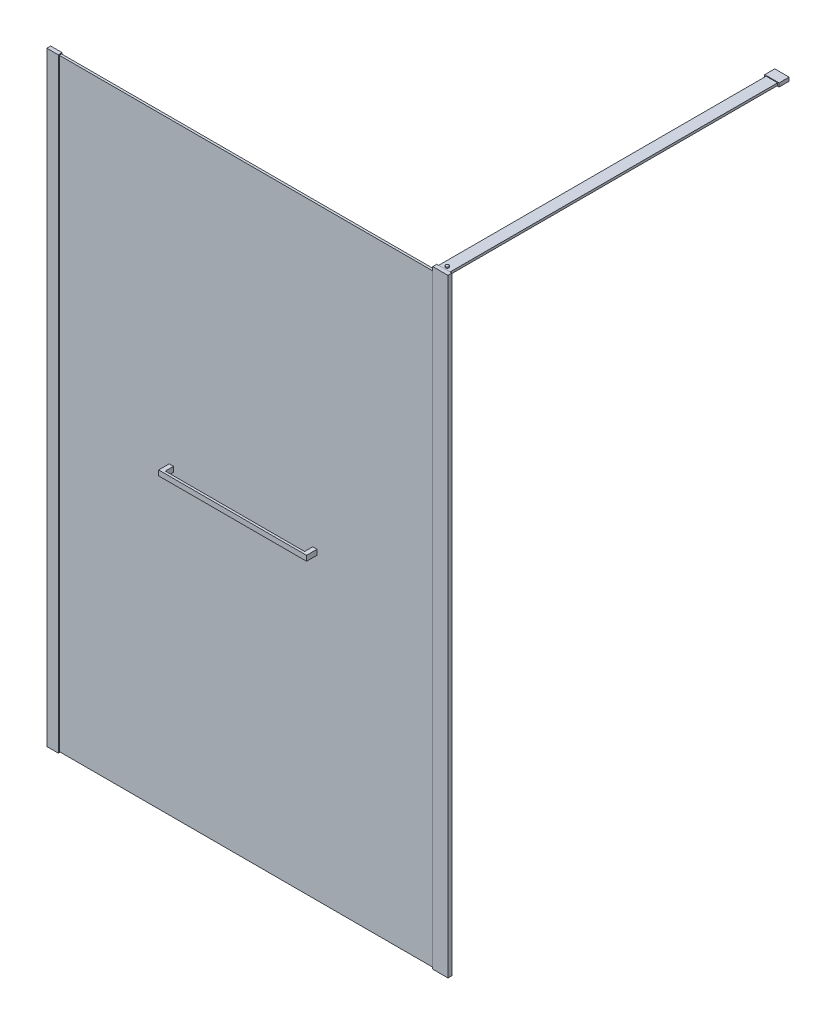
ISO-10303-21;
HEADER;
FILE_DESCRIPTION(('STEP AP214'),'2;1');
FILE_NAME('part.step','',(''),(''),'','','');
FILE_SCHEMA(('AUTOMOTIVE_DESIGN { 1 0 10303 214 1 1 1 1 }'));
ENDSEC;
DATA;
#1=APPLICATION_CONTEXT('core data for automotive mechanical design processes');
#2=APPLICATION_PROTOCOL_DEFINITION('international standard','automotive_design',2000,#1);
#3=PRODUCT_CONTEXT('',#1,'mechanical');
#4=PRODUCT('Part','Part','',(#3));
#5=PRODUCT_RELATED_PRODUCT_CATEGORY('part','',(#4));
#6=PRODUCT_DEFINITION_FORMATION('','',#4);
#7=PRODUCT_DEFINITION_CONTEXT('part definition',#1,'design');
#8=PRODUCT_DEFINITION('design','',#6,#7);
#9=PRODUCT_DEFINITION_SHAPE('','',#8);
#10=(LENGTH_UNIT() NAMED_UNIT(*) SI_UNIT(.MILLI.,.METRE.));
#11=(NAMED_UNIT(*) PLANE_ANGLE_UNIT() SI_UNIT($,.RADIAN.));
#12=(NAMED_UNIT(*) SI_UNIT($,.STERADIAN.) SOLID_ANGLE_UNIT());
#13=UNCERTAINTY_MEASURE_WITH_UNIT(LENGTH_MEASURE(1.E-05),#10,'distance_accuracy_value','');
#14=(GEOMETRIC_REPRESENTATION_CONTEXT(3) GLOBAL_UNCERTAINTY_ASSIGNED_CONTEXT((#13)) GLOBAL_UNIT_ASSIGNED_CONTEXT((#10,
#11,#12)) REPRESENTATION_CONTEXT('',''));
#15=CARTESIAN_POINT('',(0.,0.,0.));
#16=DIRECTION('',(0.,0.,1.));
#17=DIRECTION('',(1.,0.,0.));
#18=AXIS2_PLACEMENT_3D('',#15,#16,#17);
#19=CARTESIAN_POINT('',(437.5,1062.,-21.4));
#20=DIRECTION('',(1.,0.,0.));
#21=DIRECTION('',(0.,0.,-1.));
#22=AXIS2_PLACEMENT_3D('',#19,#20,#21);
#23=PLANE('',#22);
#24=DIRECTION('',(0.,1.,0.));
#25=VECTOR('',#24,1.);
#26=CARTESIAN_POINT('',(437.5,1062.,25.1));
#27=LINE('',#26,#25);
#28=CARTESIAN_POINT('',(437.5,1044.,25.1));
#29=VERTEX_POINT('',#28);
#30=CARTESIAN_POINT('',(437.5,1062.,25.1));
#31=VERTEX_POINT('',#30);
#32=EDGE_CURVE('E63',#29,#31,#27,.T.);
#33=ORIENTED_EDGE('',*,*,#32,.F.);
#34=DIRECTION('',(0.,0.,1.));
#35=VECTOR('',#34,1.);
#36=CARTESIAN_POINT('',(437.5,1044.,-21.4));
#37=LINE('',#36,#35);
#38=CARTESIAN_POINT('',(437.5,1044.,-21.4));
#39=VERTEX_POINT('',#38);
#40=EDGE_CURVE('E12',#39,#29,#37,.T.);
#41=ORIENTED_EDGE('',*,*,#40,.F.);
#42=DIRECTION('',(0.,1.,0.));
#43=VECTOR('',#42,1.);
#44=CARTESIAN_POINT('',(437.5,1062.,-21.4));
#45=LINE('',#44,#43);
#46=CARTESIAN_POINT('',(437.5,1062.,-21.4));
#47=VERTEX_POINT('',#46);
#48=EDGE_CURVE('E193',#39,#47,#45,.T.);
#49=ORIENTED_EDGE('',*,*,#48,.T.);
#50=DIRECTION('',(0.,0.,1.));
#51=VECTOR('',#50,1.);
#52=CARTESIAN_POINT('',(437.5,1062.,-21.4));
#53=LINE('',#52,#51);
#54=EDGE_CURVE('E176',#47,#31,#53,.T.);
#55=ORIENTED_EDGE('',*,*,#54,.T.);
#56=EDGE_LOOP('',(#33,#41,#49,#55));
#57=FACE_BOUND('',#56,.T.);
#58=ADVANCED_FACE('F46',(#57),#23,.T.);
#59=CARTESIAN_POINT('',(422.5,1044.,-21.4));
#60=DIRECTION('',(0.,-1.,0.));
#61=DIRECTION('',(0.,0.,-1.));
#62=AXIS2_PLACEMENT_3D('',#59,#60,#61);
#63=PLANE('',#62);
#64=ORIENTED_EDGE('',*,*,#40,.T.);
#65=DIRECTION('',(-1.,0.,0.));
#66=VECTOR('',#65,1.);
#67=CARTESIAN_POINT('',(942.197715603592,1044.,25.1));
#68=LINE('',#67,#66);
#69=CARTESIAN_POINT('',(922.5,1044.,25.1));
#70=VERTEX_POINT('',#69);
#71=EDGE_CURVE('E166',#70,#29,#68,.T.);
#72=ORIENTED_EDGE('',*,*,#71,.F.);
#73=DIRECTION('',(0.,0.,1.));
#74=VECTOR('',#73,1.);
#75=CARTESIAN_POINT('',(922.5,1044.,-21.4));
#76=LINE('',#75,#74);
#77=CARTESIAN_POINT('',(922.5,1044.,-21.4));
#78=VERTEX_POINT('',#77);
#79=EDGE_CURVE('E149',#78,#70,#76,.T.);
#80=ORIENTED_EDGE('',*,*,#79,.F.);
#81=DIRECTION('',(1.,0.,0.));
#82=VECTOR('',#81,1.);
#83=CARTESIAN_POINT('',(922.5,1044.,-21.4));
#84=LINE('',#83,#82);
#85=CARTESIAN_POINT('',(937.5,1044.,-21.4));
#86=VERTEX_POINT('',#85);
#87=EDGE_CURVE('E131',#78,#86,#84,.T.);
#88=ORIENTED_EDGE('',*,*,#87,.T.);
#89=DIRECTION('',(0.,0.,1.));
#90=VECTOR('',#89,1.);
#91=CARTESIAN_POINT('',(937.5,1044.,-21.4));
#92=LINE('',#91,#90);
#93=CARTESIAN_POINT('',(937.5,1044.,33.1));
#94=VERTEX_POINT('',#93);
#95=EDGE_CURVE('E147',#86,#94,#92,.T.);
#96=ORIENTED_EDGE('',*,*,#95,.T.);
#97=DIRECTION('',(1.,0.,0.));
#98=VECTOR('',#97,1.);
#99=CARTESIAN_POINT('',(422.5,1044.,33.1));
#100=LINE('',#99,#98);
#101=CARTESIAN_POINT('',(422.5,1044.,33.1));
#102=VERTEX_POINT('',#101);
#103=EDGE_CURVE('E135',#102,#94,#100,.T.);
#104=ORIENTED_EDGE('',*,*,#103,.F.);
#105=DIRECTION('',(0.,0.,1.));
#106=VECTOR('',#105,1.);
#107=CARTESIAN_POINT('',(422.5,1044.,-21.4));
#108=LINE('',#107,#106);
#109=CARTESIAN_POINT('',(422.5,1044.,-21.4));
#110=VERTEX_POINT('',#109);
#111=EDGE_CURVE('E55',#110,#102,#108,.T.);
#112=ORIENTED_EDGE('',*,*,#111,.F.);
#113=DIRECTION('',(1.,0.,0.));
#114=VECTOR('',#113,1.);
#115=CARTESIAN_POINT('',(422.5,1044.,-21.4));
#116=LINE('',#115,#114);
#117=EDGE_CURVE('E181',#110,#39,#116,.T.);
#118=ORIENTED_EDGE('',*,*,#117,.T.);
#119=EDGE_LOOP('',(#64,#72,#80,#88,#96,#104,#112,#118));
#120=FACE_BOUND('',#119,.T.);
#121=ADVANCED_FACE('F197',(#120),#63,.T.);
#122=CARTESIAN_POINT('',(422.5,1062.,-21.4));
#123=DIRECTION('',(-1.,0.,0.));
#124=DIRECTION('',(0.,0.,1.));
#125=AXIS2_PLACEMENT_3D('',#122,#123,#124);
#126=PLANE('',#125);
#127=ORIENTED_EDGE('',*,*,#111,.T.);
#128=DIRECTION('',(0.,-1.,0.));
#129=VECTOR('',#128,1.);
#130=CARTESIAN_POINT('',(422.5,1062.,33.1));
#131=LINE('',#130,#129);
#132=CARTESIAN_POINT('',(422.5,1062.,33.1));
#133=VERTEX_POINT('',#132);
#134=EDGE_CURVE('E121',#133,#102,#131,.T.);
#135=ORIENTED_EDGE('',*,*,#134,.F.);
#136=DIRECTION('',(0.,0.,1.));
#137=VECTOR('',#136,1.);
#138=CARTESIAN_POINT('',(422.5,1062.,-21.4));
#139=LINE('',#138,#137);
#140=CARTESIAN_POINT('',(422.5,1062.,-21.4));
#141=VERTEX_POINT('',#140);
#142=EDGE_CURVE('E116',#141,#133,#139,.T.);
#143=ORIENTED_EDGE('',*,*,#142,.F.);
#144=DIRECTION('',(0.,-1.,0.));
#145=VECTOR('',#144,1.);
#146=CARTESIAN_POINT('',(422.5,1062.,-21.4));
#147=LINE('',#146,#145);
#148=EDGE_CURVE('E186',#141,#110,#147,.T.);
#149=ORIENTED_EDGE('',*,*,#148,.T.);
#150=EDGE_LOOP('',(#127,#135,#143,#149));
#151=FACE_BOUND('',#150,.T.);
#152=ADVANCED_FACE('F218',(#151),#126,.T.);
#153=CARTESIAN_POINT('',(422.5,1062.,-21.4));
#154=DIRECTION('',(0.,1.,0.));
#155=DIRECTION('',(0.,0.,1.));
#156=AXIS2_PLACEMENT_3D('',#153,#154,#155);
#157=PLANE('',#156);
#158=ORIENTED_EDGE('',*,*,#142,.T.);
#159=DIRECTION('',(-1.,0.,0.));
#160=VECTOR('',#159,1.);
#161=CARTESIAN_POINT('',(422.5,1062.,33.1));
#162=LINE('',#161,#160);
#163=CARTESIAN_POINT('',(937.5,1062.,33.1));
#164=VERTEX_POINT('',#163);
#165=EDGE_CURVE('E109',#164,#133,#162,.T.);
#166=ORIENTED_EDGE('',*,*,#165,.F.);
#167=DIRECTION('',(0.,0.,1.));
#168=VECTOR('',#167,1.);
#169=CARTESIAN_POINT('',(937.5,1062.,-21.4));
#170=LINE('',#169,#168);
#171=CARTESIAN_POINT('',(937.5,1062.,-21.4));
#172=VERTEX_POINT('',#171);
#173=EDGE_CURVE('E113',#172,#164,#170,.T.);
#174=ORIENTED_EDGE('',*,*,#173,.F.);
#175=DIRECTION('',(-1.,0.,0.));
#176=VECTOR('',#175,1.);
#177=CARTESIAN_POINT('',(922.5,1062.,-21.4));
#178=LINE('',#177,#176);
#179=CARTESIAN_POINT('',(922.5,1062.,-21.4));
#180=VERTEX_POINT('',#179);
#181=EDGE_CURVE('E138',#172,#180,#178,.T.);
#182=ORIENTED_EDGE('',*,*,#181,.T.);
#183=DIRECTION('',(0.,0.,1.));
#184=VECTOR('',#183,1.);
#185=CARTESIAN_POINT('',(922.5,1062.,-21.4));
#186=LINE('',#185,#184);
#187=CARTESIAN_POINT('',(922.5,1062.,25.1));
#188=VERTEX_POINT('',#187);
#189=EDGE_CURVE('E130',#180,#188,#186,.T.);
#190=ORIENTED_EDGE('',*,*,#189,.T.);
#191=DIRECTION('',(-1.,0.,0.));
#192=VECTOR('',#191,1.);
#193=CARTESIAN_POINT('',(942.197715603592,1062.,25.1));
#194=LINE('',#193,#192);
#195=EDGE_CURVE('E163',#188,#31,#194,.T.);
#196=ORIENTED_EDGE('',*,*,#195,.T.);
#197=ORIENTED_EDGE('',*,*,#54,.F.);
#198=DIRECTION('',(-1.,0.,0.));
#199=VECTOR('',#198,1.);
#200=CARTESIAN_POINT('',(422.5,1062.,-21.4));
#201=LINE('',#200,#199);
#202=EDGE_CURVE('E190',#47,#141,#201,.T.);
#203=ORIENTED_EDGE('',*,*,#202,.T.);
#204=EDGE_LOOP('',(#158,#166,#174,#182,#190,#196,#197,#203));
#205=FACE_BOUND('',#204,.T.);
#206=ADVANCED_FACE('F111',(#205),#157,.T.);
#207=CARTESIAN_POINT('',(437.5,1044.,-21.4));
#208=DIRECTION('',(0.,0.,1.));
#209=DIRECTION('',(1.,0.,0.));
#210=AXIS2_PLACEMENT_3D('',#207,#208,#209);
#211=PLANE('',#210);
#212=ORIENTED_EDGE('',*,*,#48,.F.);
#213=ORIENTED_EDGE('',*,*,#117,.F.);
#214=ORIENTED_EDGE('',*,*,#148,.F.);
#215=ORIENTED_EDGE('',*,*,#202,.F.);
#216=EDGE_LOOP('',(#212,#213,#214,#215));
#217=FACE_BOUND('',#216,.T.);
#218=ADVANCED_FACE('F225',(#217),#211,.F.);
#219=CARTESIAN_POINT('',(437.5,1044.,33.1));
#220=DIRECTION('',(0.,0.,1.));
#221=DIRECTION('',(1.,0.,0.));
#222=AXIS2_PLACEMENT_3D('',#219,#220,#221);
#223=PLANE('',#222);
#224=ORIENTED_EDGE('',*,*,#103,.T.);
#225=DIRECTION('',(0.,1.,0.));
#226=VECTOR('',#225,1.);
#227=CARTESIAN_POINT('',(937.5,1062.,33.1));
#228=LINE('',#227,#226);
#229=EDGE_CURVE('E127',#94,#164,#228,.T.);
#230=ORIENTED_EDGE('',*,*,#229,.T.);
#231=ORIENTED_EDGE('',*,*,#165,.T.);
#232=ORIENTED_EDGE('',*,*,#134,.T.);
#233=EDGE_LOOP('',(#224,#230,#231,#232));
#234=FACE_BOUND('',#233,.T.);
#235=ADVANCED_FACE('F133',(#234),#223,.T.);
#236=CARTESIAN_POINT('',(942.197715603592,1062.,25.1));
#237=DIRECTION('',(0.,0.,1.));
#238=DIRECTION('',(1.,0.,0.));
#239=AXIS2_PLACEMENT_3D('',#236,#237,#238);
#240=PLANE('',#239);
#241=ORIENTED_EDGE('',*,*,#195,.F.);
#242=DIRECTION('',(0.,-1.,0.));
#243=VECTOR('',#242,1.);
#244=CARTESIAN_POINT('',(922.5,1062.,25.1));
#245=LINE('',#244,#243);
#246=EDGE_CURVE('E49',#188,#70,#245,.T.);
#247=ORIENTED_EDGE('',*,*,#246,.T.);
#248=ORIENTED_EDGE('',*,*,#71,.T.);
#249=ORIENTED_EDGE('',*,*,#32,.T.);
#250=EDGE_LOOP('',(#241,#247,#248,#249));
#251=FACE_BOUND('',#250,.T.);
#252=ADVANCED_FACE('F203',(#251),#240,.F.);
#253=CARTESIAN_POINT('',(922.5,1062.,-21.4));
#254=DIRECTION('',(-1.,0.,0.));
#255=DIRECTION('',(0.,0.,1.));
#256=AXIS2_PLACEMENT_3D('',#253,#254,#255);
#257=PLANE('',#256);
#258=ORIENTED_EDGE('',*,*,#246,.F.);
#259=ORIENTED_EDGE('',*,*,#189,.F.);
#260=DIRECTION('',(0.,-1.,0.));
#261=VECTOR('',#260,1.);
#262=CARTESIAN_POINT('',(922.5,1062.,-21.4));
#263=LINE('',#262,#261);
#264=EDGE_CURVE('E142',#180,#78,#263,.T.);
#265=ORIENTED_EDGE('',*,*,#264,.T.);
#266=ORIENTED_EDGE('',*,*,#79,.T.);
#267=EDGE_LOOP('',(#258,#259,#265,#266));
#268=FACE_BOUND('',#267,.T.);
#269=ADVANCED_FACE('F204',(#268),#257,.T.);
#270=CARTESIAN_POINT('',(937.5,1062.,-21.4));
#271=DIRECTION('',(1.,0.,0.));
#272=DIRECTION('',(0.,0.,-1.));
#273=AXIS2_PLACEMENT_3D('',#270,#271,#272);
#274=PLANE('',#273);
#275=ORIENTED_EDGE('',*,*,#173,.T.);
#276=ORIENTED_EDGE('',*,*,#229,.F.);
#277=ORIENTED_EDGE('',*,*,#95,.F.);
#278=DIRECTION('',(0.,1.,0.));
#279=VECTOR('',#278,1.);
#280=CARTESIAN_POINT('',(937.5,1062.,-21.4));
#281=LINE('',#280,#279);
#282=EDGE_CURVE('E129',#86,#172,#281,.T.);
#283=ORIENTED_EDGE('',*,*,#282,.T.);
#284=EDGE_LOOP('',(#275,#276,#277,#283));
#285=FACE_BOUND('',#284,.T.);
#286=ADVANCED_FACE('F126',(#285),#274,.T.);
#287=CARTESIAN_POINT('',(937.5,1044.,-21.4));
#288=DIRECTION('',(0.,0.,1.));
#289=DIRECTION('',(1.,0.,0.));
#290=AXIS2_PLACEMENT_3D('',#287,#288,#289);
#291=PLANE('',#290);
#292=ORIENTED_EDGE('',*,*,#282,.F.);
#293=ORIENTED_EDGE('',*,*,#87,.F.);
#294=ORIENTED_EDGE('',*,*,#264,.F.);
#295=ORIENTED_EDGE('',*,*,#181,.F.);
#296=EDGE_LOOP('',(#292,#293,#294,#295));
#297=FACE_BOUND('',#296,.T.);
#298=ADVANCED_FACE('F200',(#297),#291,.F.);
#299=CLOSED_SHELL('',(#58,#121,#152,#206,#218,#235,#252,#269,#286,#298));
#300=MANIFOLD_SOLID_BREP('B2',#299);
#301=CARTESIAN_POINT('',(1389.9,2119.,-1184.4));
#302=DIRECTION('',(-1.,0.,0.));
#303=DIRECTION('',(0.,0.,1.));
#304=AXIS2_PLACEMENT_3D('',#301,#302,#303);
#305=PLANE('',#304);
#306=DIRECTION('',(0.,-1.,0.));
#307=VECTOR('',#306,1.);
#308=CARTESIAN_POINT('',(1389.9,2119.,-1155.));
#309=LINE('',#308,#307);
#310=CARTESIAN_POINT('',(1389.9,2119.,-1155.));
#311=VERTEX_POINT('',#310);
#312=CARTESIAN_POINT('',(1389.9,2111.,-1155.));
#313=VERTEX_POINT('',#312);
#314=EDGE_CURVE('E417',#311,#313,#309,.T.);
#315=ORIENTED_EDGE('',*,*,#314,.F.);
#316=DIRECTION('',(0.,0.,1.));
#317=VECTOR('',#316,1.);
#318=CARTESIAN_POINT('',(1389.9,2119.,-1184.4));
#319=LINE('',#318,#317);
#320=CARTESIAN_POINT('',(1389.9,2119.,-14.3999999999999));
#321=VERTEX_POINT('',#320);
#322=EDGE_CURVE('E432',#311,#321,#319,.T.);
#323=ORIENTED_EDGE('',*,*,#322,.T.);
#324=DIRECTION('',(0.,-1.,0.));
#325=VECTOR('',#324,1.);
#326=CARTESIAN_POINT('',(1389.9,2119.,-14.3999999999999));
#327=LINE('',#326,#325);
#328=CARTESIAN_POINT('',(1389.9,2111.,-14.3999999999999));
#329=VERTEX_POINT('',#328);
#330=EDGE_CURVE('E420',#321,#329,#327,.T.);
#331=ORIENTED_EDGE('',*,*,#330,.T.);
#332=DIRECTION('',(0.,0.,1.));
#333=VECTOR('',#332,1.);
#334=CARTESIAN_POINT('',(1389.9,2111.,-1184.4));
#335=LINE('',#334,#333);
#336=EDGE_CURVE('E327',#313,#329,#335,.T.);
#337=ORIENTED_EDGE('',*,*,#336,.F.);
#338=EDGE_LOOP('',(#315,#323,#331,#337));
#339=FACE_BOUND('',#338,.T.);
#340=ADVANCED_FACE('F319',(#339),#305,.F.);
#341=CARTESIAN_POINT('',(1389.9,2111.,-1184.4));
#342=DIRECTION('',(0.,1.,0.));
#343=DIRECTION('',(0.,0.,1.));
#344=AXIS2_PLACEMENT_3D('',#341,#342,#343);
#345=PLANE('',#344);
#346=DIRECTION('',(-1.,0.,0.));
#347=VECTOR('',#346,1.);
#348=CARTESIAN_POINT('',(1389.9,2111.,-1155.));
#349=LINE('',#348,#347);
#350=CARTESIAN_POINT('',(1349.9,2111.,-1155.));
#351=VERTEX_POINT('',#350);
#352=EDGE_CURVE('E334',#313,#351,#349,.T.);
#353=ORIENTED_EDGE('',*,*,#352,.F.);
#354=ORIENTED_EDGE('',*,*,#336,.T.);
#355=DIRECTION('',(-1.,0.,0.));
#356=VECTOR('',#355,1.);
#357=CARTESIAN_POINT('',(1389.9,2111.,-14.3999999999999));
#358=LINE('',#357,#356);
#359=CARTESIAN_POINT('',(1349.9,2111.,-14.3999999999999));
#360=VERTEX_POINT('',#359);
#361=EDGE_CURVE('E423',#329,#360,#358,.T.);
#362=ORIENTED_EDGE('',*,*,#361,.T.);
#363=DIRECTION('',(0.,0.,1.));
#364=VECTOR('',#363,1.);
#365=CARTESIAN_POINT('',(1349.9,2111.,-1184.4));
#366=LINE('',#365,#364);
#367=EDGE_CURVE('E436',#351,#360,#366,.T.);
#368=ORIENTED_EDGE('',*,*,#367,.F.);
#369=EDGE_LOOP('',(#353,#354,#362,#368));
#370=FACE_BOUND('',#369,.T.);
#371=ADVANCED_FACE('F438',(#370),#345,.F.);
#372=CARTESIAN_POINT('',(1349.9,2119.,-1184.4));
#373=DIRECTION('',(1.,0.,0.));
#374=DIRECTION('',(0.,0.,-1.));
#375=AXIS2_PLACEMENT_3D('',#372,#373,#374);
#376=PLANE('',#375);
#377=DIRECTION('',(0.,1.,0.));
#378=VECTOR('',#377,1.);
#379=CARTESIAN_POINT('',(1349.9,2119.,-1155.));
#380=LINE('',#379,#378);
#381=CARTESIAN_POINT('',(1349.9,2119.,-1155.));
#382=VERTEX_POINT('',#381);
#383=EDGE_CURVE('E342',#351,#382,#380,.T.);
#384=ORIENTED_EDGE('',*,*,#383,.F.);
#385=ORIENTED_EDGE('',*,*,#367,.T.);
#386=DIRECTION('',(0.,1.,0.));
#387=VECTOR('',#386,1.);
#388=CARTESIAN_POINT('',(1349.9,2119.,-14.3999999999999));
#389=LINE('',#388,#387);
#390=CARTESIAN_POINT('',(1349.9,2119.,-14.3999999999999));
#391=VERTEX_POINT('',#390);
#392=EDGE_CURVE('E426',#360,#391,#389,.T.);
#393=ORIENTED_EDGE('',*,*,#392,.T.);
#394=DIRECTION('',(0.,0.,1.));
#395=VECTOR('',#394,1.);
#396=CARTESIAN_POINT('',(1349.9,2119.,-1184.4));
#397=LINE('',#396,#395);
#398=EDGE_CURVE('E434',#382,#391,#397,.T.);
#399=ORIENTED_EDGE('',*,*,#398,.F.);
#400=EDGE_LOOP('',(#384,#385,#393,#399));
#401=FACE_BOUND('',#400,.T.);
#402=ADVANCED_FACE('F448',(#401),#376,.F.);
#403=CARTESIAN_POINT('',(1389.9,2119.,-1184.4));
#404=DIRECTION('',(0.,-1.,0.));
#405=DIRECTION('',(0.,0.,-1.));
#406=AXIS2_PLACEMENT_3D('',#403,#404,#405);
#407=PLANE('',#406);
#408=CARTESIAN_POINT('',(1369.9,2119.,-24.3999999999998));
#409=DIRECTION('',(0.,-1.,0.));
#410=DIRECTION('',(0.,0.,-1.));
#411=AXIS2_PLACEMENT_3D('',#408,#409,#410);
#412=CIRCLE('',#411,5.90000000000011);
#413=CARTESIAN_POINT('',(1369.9,2119.,-30.2999999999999));
#414=VERTEX_POINT('',#413);
#415=EDGE_CURVE('E511',#414,#414,#412,.T.);
#416=ORIENTED_EDGE('',*,*,#415,.T.);
#417=EDGE_LOOP('',(#416));
#418=FACE_BOUND('',#417,.T.);
#419=DIRECTION('',(1.,0.,0.));
#420=VECTOR('',#419,1.);
#421=CARTESIAN_POINT('',(1389.9,2119.,-1155.));
#422=LINE('',#421,#420);
#423=EDGE_CURVE('E44',#382,#311,#422,.T.);
#424=ORIENTED_EDGE('',*,*,#423,.F.);
#425=ORIENTED_EDGE('',*,*,#398,.T.);
#426=DIRECTION('',(1.,0.,0.));
#427=VECTOR('',#426,1.);
#428=CARTESIAN_POINT('',(1389.9,2119.,-14.3999999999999));
#429=LINE('',#428,#427);
#430=EDGE_CURVE('E429',#391,#321,#429,.T.);
#431=ORIENTED_EDGE('',*,*,#430,.T.);
#432=ORIENTED_EDGE('',*,*,#322,.F.);
#433=EDGE_LOOP('',(#424,#425,#431,#432));
#434=FACE_BOUND('',#433,.T.);
#435=ADVANCED_FACE('F447',(#418,#434),#407,.F.);
#436=CARTESIAN_POINT('',(1389.9,2111.,-14.3999999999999));
#437=DIRECTION('',(0.,0.,-1.));
#438=DIRECTION('',(-1.,0.,0.));
#439=AXIS2_PLACEMENT_3D('',#436,#437,#438);
#440=PLANE('',#439);
#441=ORIENTED_EDGE('',*,*,#330,.F.);
#442=ORIENTED_EDGE('',*,*,#430,.F.);
#443=ORIENTED_EDGE('',*,*,#392,.F.);
#444=ORIENTED_EDGE('',*,*,#361,.F.);
#445=EDGE_LOOP('',(#441,#442,#443,#444));
#446=FACE_BOUND('',#445,.T.);
#447=ADVANCED_FACE('F444',(#446),#440,.F.);
#448=CARTESIAN_POINT('',(1344.9,2108.75,-1155.));
#449=DIRECTION('',(0.,0.,-1.));
#450=DIRECTION('',(-1.,0.,0.));
#451=AXIS2_PLACEMENT_3D('',#448,#449,#450);
#452=PLANE('',#451);
#453=DIRECTION('',(0.,1.,0.));
#454=VECTOR('',#453,1.);
#455=CARTESIAN_POINT('',(1344.9,2121.25,-1155.));
#456=LINE('',#455,#454);
#457=CARTESIAN_POINT('',(1344.9,2108.75,-1155.));
#458=VERTEX_POINT('',#457);
#459=CARTESIAN_POINT('',(1344.9,2121.25,-1155.));
#460=VERTEX_POINT('',#459);
#461=EDGE_CURVE('E409',#458,#460,#456,.T.);
#462=ORIENTED_EDGE('',*,*,#461,.F.);
#463=DIRECTION('',(-1.,0.,0.));
#464=VECTOR('',#463,1.);
#465=CARTESIAN_POINT('',(1394.9,2108.75,-1155.));
#466=LINE('',#465,#464);
#467=CARTESIAN_POINT('',(1394.9,2108.75,-1155.));
#468=VERTEX_POINT('',#467);
#469=EDGE_CURVE('E405',#468,#458,#466,.T.);
#470=ORIENTED_EDGE('',*,*,#469,.F.);
#471=DIRECTION('',(0.,-1.,0.));
#472=VECTOR('',#471,1.);
#473=CARTESIAN_POINT('',(1394.9,2121.25,-1155.));
#474=LINE('',#473,#472);
#475=CARTESIAN_POINT('',(1394.9,2121.25,-1155.));
#476=VERTEX_POINT('',#475);
#477=EDGE_CURVE('E492',#476,#468,#474,.T.);
#478=ORIENTED_EDGE('',*,*,#477,.F.);
#479=DIRECTION('',(1.,0.,0.));
#480=VECTOR('',#479,1.);
#481=CARTESIAN_POINT('',(1394.9,2121.25,-1155.));
#482=LINE('',#481,#480);
#483=EDGE_CURVE('E495',#460,#476,#482,.T.);
#484=ORIENTED_EDGE('',*,*,#483,.F.);
#485=EDGE_LOOP('',(#462,#470,#478,#484));
#486=FACE_BOUND('',#485,.T.);
#487=ORIENTED_EDGE('',*,*,#423,.T.);
#488=ORIENTED_EDGE('',*,*,#314,.T.);
#489=ORIENTED_EDGE('',*,*,#352,.T.);
#490=ORIENTED_EDGE('',*,*,#383,.T.);
#491=EDGE_LOOP('',(#487,#488,#489,#490));
#492=FACE_BOUND('',#491,.T.);
#493=ADVANCED_FACE('F450',(#486,#492),#452,.F.);
#494=CARTESIAN_POINT('',(1344.9,2121.25,-1190.));
#495=DIRECTION('',(1.,0.,0.));
#496=DIRECTION('',(0.,0.,-1.));
#497=AXIS2_PLACEMENT_3D('',#494,#495,#496);
#498=PLANE('',#497);
#499=ORIENTED_EDGE('',*,*,#461,.T.);
#500=DIRECTION('',(0.,0.,1.));
#501=VECTOR('',#500,1.);
#502=CARTESIAN_POINT('',(1344.9,2121.25,-1190.));
#503=LINE('',#502,#501);
#504=CARTESIAN_POINT('',(1344.9,2121.25,-1190.));
#505=VERTEX_POINT('',#504);
#506=EDGE_CURVE('E389',#505,#460,#503,.T.);
#507=ORIENTED_EDGE('',*,*,#506,.F.);
#508=DIRECTION('',(0.,1.,0.));
#509=VECTOR('',#508,1.);
#510=CARTESIAN_POINT('',(1344.9,2121.25,-1190.));
#511=LINE('',#510,#509);
#512=CARTESIAN_POINT('',(1344.9,2108.75,-1190.));
#513=VERTEX_POINT('',#512);
#514=EDGE_CURVE('E396',#513,#505,#511,.T.);
#515=ORIENTED_EDGE('',*,*,#514,.F.);
#516=DIRECTION('',(0.,0.,1.));
#517=VECTOR('',#516,1.);
#518=CARTESIAN_POINT('',(1344.9,2108.75,-1190.));
#519=LINE('',#518,#517);
#520=EDGE_CURVE('E489',#513,#458,#519,.T.);
#521=ORIENTED_EDGE('',*,*,#520,.T.);
#522=EDGE_LOOP('',(#499,#507,#515,#521));
#523=FACE_BOUND('',#522,.T.);
#524=ADVANCED_FACE('F407',(#523),#498,.F.);
#525=CARTESIAN_POINT('',(1394.9,2121.25,-1190.));
#526=DIRECTION('',(0.,-1.,0.));
#527=DIRECTION('',(0.,0.,-1.));
#528=AXIS2_PLACEMENT_3D('',#525,#526,#527);
#529=PLANE('',#528);
#530=ORIENTED_EDGE('',*,*,#483,.T.);
#531=DIRECTION('',(0.,0.,1.));
#532=VECTOR('',#531,1.);
#533=CARTESIAN_POINT('',(1394.9,2121.25,-1190.));
#534=LINE('',#533,#532);
#535=CARTESIAN_POINT('',(1394.9,2121.25,-1190.));
#536=VERTEX_POINT('',#535);
#537=EDGE_CURVE('E392',#536,#476,#534,.T.);
#538=ORIENTED_EDGE('',*,*,#537,.F.);
#539=DIRECTION('',(1.,0.,0.));
#540=VECTOR('',#539,1.);
#541=CARTESIAN_POINT('',(1394.9,2121.25,-1190.));
#542=LINE('',#541,#540);
#543=EDGE_CURVE('E385',#505,#536,#542,.T.);
#544=ORIENTED_EDGE('',*,*,#543,.F.);
#545=ORIENTED_EDGE('',*,*,#506,.T.);
#546=EDGE_LOOP('',(#530,#538,#544,#545));
#547=FACE_BOUND('',#546,.T.);
#548=ADVANCED_FACE('F387',(#547),#529,.F.);
#549=CARTESIAN_POINT('',(1394.9,2121.25,-1190.));
#550=DIRECTION('',(-1.,0.,0.));
#551=DIRECTION('',(0.,0.,1.));
#552=AXIS2_PLACEMENT_3D('',#549,#550,#551);
#553=PLANE('',#552);
#554=ORIENTED_EDGE('',*,*,#477,.T.);
#555=DIRECTION('',(0.,0.,1.));
#556=VECTOR('',#555,1.);
#557=CARTESIAN_POINT('',(1394.9,2108.75,-1190.));
#558=LINE('',#557,#556);
#559=CARTESIAN_POINT('',(1394.9,2108.75,-1190.));
#560=VERTEX_POINT('',#559);
#561=EDGE_CURVE('E412',#560,#468,#558,.T.);
#562=ORIENTED_EDGE('',*,*,#561,.F.);
#563=DIRECTION('',(0.,-1.,0.));
#564=VECTOR('',#563,1.);
#565=CARTESIAN_POINT('',(1394.9,2121.25,-1190.));
#566=LINE('',#565,#564);
#567=EDGE_CURVE('E395',#536,#560,#566,.T.);
#568=ORIENTED_EDGE('',*,*,#567,.F.);
#569=ORIENTED_EDGE('',*,*,#537,.T.);
#570=EDGE_LOOP('',(#554,#562,#568,#569));
#571=FACE_BOUND('',#570,.T.);
#572=ADVANCED_FACE('F477',(#571),#553,.F.);
#573=CARTESIAN_POINT('',(1394.9,2108.75,-1190.));
#574=DIRECTION('',(0.,1.,0.));
#575=DIRECTION('',(0.,0.,1.));
#576=AXIS2_PLACEMENT_3D('',#573,#574,#575);
#577=PLANE('',#576);
#578=ORIENTED_EDGE('',*,*,#469,.T.);
#579=ORIENTED_EDGE('',*,*,#520,.F.);
#580=DIRECTION('',(-1.,0.,0.));
#581=VECTOR('',#580,1.);
#582=CARTESIAN_POINT('',(1394.9,2108.75,-1190.));
#583=LINE('',#582,#581);
#584=EDGE_CURVE('E401',#560,#513,#583,.T.);
#585=ORIENTED_EDGE('',*,*,#584,.F.);
#586=ORIENTED_EDGE('',*,*,#561,.T.);
#587=EDGE_LOOP('',(#578,#579,#585,#586));
#588=FACE_BOUND('',#587,.T.);
#589=ADVANCED_FACE('F479',(#588),#577,.F.);
#590=CARTESIAN_POINT('',(1344.9,2108.75,-1190.));
#591=DIRECTION('',(0.,0.,-1.));
#592=DIRECTION('',(-1.,0.,0.));
#593=AXIS2_PLACEMENT_3D('',#590,#591,#592);
#594=PLANE('',#593);
#595=ORIENTED_EDGE('',*,*,#514,.T.);
#596=ORIENTED_EDGE('',*,*,#543,.T.);
#597=ORIENTED_EDGE('',*,*,#567,.T.);
#598=ORIENTED_EDGE('',*,*,#584,.T.);
#599=EDGE_LOOP('',(#595,#596,#597,#598));
#600=FACE_BOUND('',#599,.T.);
#601=ADVANCED_FACE('F399',(#600),#594,.T.);
#602=CARTESIAN_POINT('',(1369.9,2115.34934210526,-24.3999999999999));
#603=DIRECTION('',(0.,-1.,0.));
#604=DIRECTION('',(0.,0.,-1.));
#605=AXIS2_PLACEMENT_3D('',#602,#603,#604);
#606=SPHERICAL_SURFACE('',#605,9.35065789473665);
#607=CARTESIAN_POINT('',(1369.9,2122.8,-24.3999999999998));
#608=DIRECTION('',(0.,-1.,0.));
#609=DIRECTION('',(0.,0.,-1.));
#610=AXIS2_PLACEMENT_3D('',#607,#608,#609);
#611=CIRCLE('',#610,5.65000000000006);
#612=CARTESIAN_POINT('',(1369.9,2122.8,-30.0499999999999));
#613=VERTEX_POINT('',#612);
#614=EDGE_CURVE('E508',#613,#613,#611,.T.);
#615=ORIENTED_EDGE('',*,*,#614,.F.);
#616=EDGE_LOOP('',(#615));
#617=FACE_BOUND('',#616,.T.);
#618=ADVANCED_FACE('F486',(#617),#606,.T.);
#619=CARTESIAN_POINT('',(1369.9,2119.,-24.3999999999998));
#620=DIRECTION('',(0.,-1.,0.));
#621=DIRECTION('',(0.,0.,-1.));
#622=AXIS2_PLACEMENT_3D('',#619,#620,#621);
#623=CONICAL_SURFACE('',#622,5.90000000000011,0.0656948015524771);
#624=ORIENTED_EDGE('',*,*,#614,.T.);
#625=EDGE_LOOP('',(#624));
#626=FACE_BOUND('',#625,.T.);
#627=ORIENTED_EDGE('',*,*,#415,.F.);
#628=EDGE_LOOP('',(#627));
#629=FACE_BOUND('',#628,.T.);
#630=ADVANCED_FACE('F515',(#626,#629),#623,.T.);
#631=CLOSED_SHELL('',(#340,#371,#402,#435,#447,#493,#524,#548,#572,#589,#601,#618,#630));
#632=CARTESIAN_POINT('',(1369.9,2122.53567623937,-24.3999999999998));
#633=DIRECTION('',(0.,-1.,0.));
#634=DIRECTION('',(0.,0.,-1.));
#635=AXIS2_PLACEMENT_3D('',#632,#633,#634);
#636=CONICAL_SURFACE('',#635,5.1663088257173,0.0656948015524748);
#637=CARTESIAN_POINT('',(1369.9,2119.,-24.3999999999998));
#638=DIRECTION('',(0.,-1.,0.));
#639=DIRECTION('',(0.,0.,-1.));
#640=AXIS2_PLACEMENT_3D('',#637,#638,#639);
#641=CIRCLE('',#640,5.398919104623);
#642=CARTESIAN_POINT('',(1369.9,2119.,-29.7989191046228));
#643=VERTEX_POINT('',#642);
#644=EDGE_CURVE('E496',#643,#643,#641,.T.);
#645=ORIENTED_EDGE('',*,*,#644,.T.);
#646=EDGE_LOOP('',(#645));
#647=FACE_BOUND('',#646,.T.);
#648=CARTESIAN_POINT('',(1369.9,2122.53567623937,-24.3999999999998));
#649=DIRECTION('',(0.,-1.,0.));
#650=DIRECTION('',(0.,0.,-1.));
#651=AXIS2_PLACEMENT_3D('',#648,#649,#650);
#652=CIRCLE('',#651,5.1663088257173);
#653=CARTESIAN_POINT('',(1369.9,2122.53567623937,-29.5663088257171));
#654=VERTEX_POINT('',#653);
#655=EDGE_CURVE('E500',#654,#654,#652,.T.);
#656=ORIENTED_EDGE('',*,*,#655,.F.);
#657=EDGE_LOOP('',(#656));
#658=FACE_BOUND('',#657,.T.);
#659=ADVANCED_FACE('F529',(#647,#658),#636,.F.);
#660=CARTESIAN_POINT('',(1369.9,2115.34934210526,-24.3999999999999));
#661=DIRECTION('',(0.,-1.,0.));
#662=DIRECTION('',(0.,0.,1.));
#663=AXIS2_PLACEMENT_3D('',#660,#661,#662);
#664=SPHERICAL_SURFACE('',#663,8.85065789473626);
#665=ORIENTED_EDGE('',*,*,#655,.T.);
#666=EDGE_LOOP('',(#665));
#667=FACE_BOUND('',#666,.T.);
#668=ADVANCED_FACE('F526',(#667),#664,.F.);
#669=ORIENTED_EDGE('',*,*,#644,.F.);
#670=EDGE_LOOP('',(#669));
#671=FACE_BOUND('',#670,.T.);
#672=ADVANCED_FACE('F473',(#671),#407,.F.);
#673=CLOSED_SHELL('',(#659,#668,#672));
#674=ORIENTED_CLOSED_SHELL('',*,#673,.T.);
#675=BREP_WITH_VOIDS('B6',#631,(#674));
#676=CARTESIAN_POINT('',(1396.4,2111.,-0.399999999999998));
#677=DIRECTION('',(0.,-1.,0.));
#678=DIRECTION('',(0.,0.,-1.));
#679=AXIS2_PLACEMENT_3D('',#676,#677,#678);
#680=PLANE('',#679);
#681=DIRECTION('',(-1.,0.,0.));
#682=VECTOR('',#681,1.);
#683=CARTESIAN_POINT('',(1343.4,2111.,-11.4));
#684=LINE('',#683,#682);
#685=CARTESIAN_POINT('',(1344.7,2111.,-11.4));
#686=VERTEX_POINT('',#685);
#687=CARTESIAN_POINT('',(1343.4,2111.,-11.4));
#688=VERTEX_POINT('',#687);
#689=EDGE_CURVE('E781',#686,#688,#684,.T.);
#690=ORIENTED_EDGE('',*,*,#689,.F.);
#691=DIRECTION('',(0.,0.,1.));
#692=VECTOR('',#691,1.);
#693=CARTESIAN_POINT('',(1344.7,2111.,-0.399999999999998));
#694=LINE('',#693,#692);
#695=CARTESIAN_POINT('',(1344.7,2111.,-3.39999999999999));
#696=VERTEX_POINT('',#695);
#697=EDGE_CURVE('E647',#686,#696,#694,.T.);
#698=ORIENTED_EDGE('',*,*,#697,.T.);
#699=DIRECTION('',(1.,0.,0.));
#700=VECTOR('',#699,1.);
#701=CARTESIAN_POINT('',(1353.5,2111.,-3.39999999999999));
#702=LINE('',#701,#700);
#703=CARTESIAN_POINT('',(1343.4,2111.,-3.39999999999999));
#704=VERTEX_POINT('',#703);
#705=EDGE_CURVE('E785',#704,#696,#702,.T.);
#706=ORIENTED_EDGE('',*,*,#705,.F.);
#707=DIRECTION('',(0.,0.,1.));
#708=VECTOR('',#707,1.);
#709=CARTESIAN_POINT('',(1343.4,2111.,-14.4));
#710=LINE('',#709,#708);
#711=EDGE_CURVE('E762',#688,#704,#710,.T.);
#712=ORIENTED_EDGE('',*,*,#711,.F.);
#713=EDGE_LOOP('',(#690,#698,#706,#712));
#714=FACE_BOUND('',#713,.T.);
#715=ADVANCED_FACE('F638',(#714),#680,.T.);
#716=CARTESIAN_POINT('',(1353.5,2111.,-3.39999999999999));
#717=DIRECTION('',(0.,0.,-1.));
#718=DIRECTION('',(-1.,0.,0.));
#719=AXIS2_PLACEMENT_3D('',#716,#717,#718);
#720=PLANE('',#719);
#721=DIRECTION('',(-1.,0.,0.));
#722=VECTOR('',#721,1.);
#723=CARTESIAN_POINT('',(1353.5,2103.2,-3.39999999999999));
#724=LINE('',#723,#722);
#725=CARTESIAN_POINT('',(1353.5,2103.2,-3.39999999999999));
#726=VERTEX_POINT('',#725);
#727=CARTESIAN_POINT('',(1344.7,2103.2,-3.39999999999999));
#728=VERTEX_POINT('',#727);
#729=EDGE_CURVE('E760',#726,#728,#724,.T.);
#730=ORIENTED_EDGE('',*,*,#729,.F.);
#731=DIRECTION('',(0.,-1.,0.));
#732=VECTOR('',#731,1.);
#733=CARTESIAN_POINT('',(1353.5,2111.,-3.39999999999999));
#734=LINE('',#733,#732);
#735=CARTESIAN_POINT('',(1353.5,3.,-3.39999999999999));
#736=VERTEX_POINT('',#735);
#737=EDGE_CURVE('E784',#726,#736,#734,.T.);
#738=ORIENTED_EDGE('',*,*,#737,.T.);
#739=DIRECTION('',(1.,0.,0.));
#740=VECTOR('',#739,1.);
#741=CARTESIAN_POINT('',(1353.5,3.,-3.39999999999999));
#742=LINE('',#741,#740);
#743=CARTESIAN_POINT('',(1343.4,3.,-3.39999999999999));
#744=VERTEX_POINT('',#743);
#745=EDGE_CURVE('E772',#744,#736,#742,.T.);
#746=ORIENTED_EDGE('',*,*,#745,.F.);
#747=DIRECTION('',(0.,-1.,0.));
#748=VECTOR('',#747,1.);
#749=CARTESIAN_POINT('',(1343.4,2111.,-3.39999999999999));
#750=LINE('',#749,#748);
#751=EDGE_CURVE('E663',#704,#744,#750,.T.);
#752=ORIENTED_EDGE('',*,*,#751,.F.);
#753=ORIENTED_EDGE('',*,*,#705,.T.);
#754=DIRECTION('',(0.,-1.,0.));
#755=VECTOR('',#754,1.);
#756=CARTESIAN_POINT('',(1344.7,2111.,-3.39999999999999));
#757=LINE('',#756,#755);
#758=EDGE_CURVE('E655',#696,#728,#757,.T.);
#759=ORIENTED_EDGE('',*,*,#758,.T.);
#760=EDGE_LOOP('',(#730,#738,#746,#752,#753,#759));
#761=FACE_BOUND('',#760,.T.);
#762=ADVANCED_FACE('F640',(#761),#720,.T.);
#763=CARTESIAN_POINT('',(1343.4,2111.,-3.39999999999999));
#764=DIRECTION('',(-1.,0.,0.));
#765=DIRECTION('',(0.,0.,1.));
#766=AXIS2_PLACEMENT_3D('',#763,#764,#765);
#767=PLANE('',#766);
#768=DIRECTION('',(0.,-1.,0.));
#769=VECTOR('',#768,1.);
#770=CARTESIAN_POINT('',(1343.4,2111.,-14.4));
#771=LINE('',#770,#769);
#772=CARTESIAN_POINT('',(1343.4,2119.,-14.4));
#773=VERTEX_POINT('',#772);
#774=CARTESIAN_POINT('',(1343.4,0.,-14.4));
#775=VERTEX_POINT('',#774);
#776=EDGE_CURVE('E719',#773,#775,#771,.T.);
#777=ORIENTED_EDGE('',*,*,#776,.T.);
#778=DIRECTION('',(0.,0.,-1.));
#779=VECTOR('',#778,1.);
#780=CARTESIAN_POINT('',(1343.4,0.,-0.399999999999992));
#781=LINE('',#780,#779);
#782=CARTESIAN_POINT('',(1343.4,0.,-0.399999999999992));
#783=VERTEX_POINT('',#782);
#784=EDGE_CURVE('E723',#783,#775,#781,.T.);
#785=ORIENTED_EDGE('',*,*,#784,.F.);
#786=DIRECTION('',(0.,-1.,0.));
#787=VECTOR('',#786,1.);
#788=CARTESIAN_POINT('',(1343.4,2111.,-0.399999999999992));
#789=LINE('',#788,#787);
#790=CARTESIAN_POINT('',(1343.4,2119.,-0.399999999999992));
#791=VERTEX_POINT('',#790);
#792=EDGE_CURVE('E793',#791,#783,#789,.T.);
#793=ORIENTED_EDGE('',*,*,#792,.F.);
#794=DIRECTION('',(0.,0.,1.));
#795=VECTOR('',#794,1.);
#796=CARTESIAN_POINT('',(1343.4,2119.,-14.4));
#797=LINE('',#796,#795);
#798=EDGE_CURVE('E725',#773,#791,#797,.T.);
#799=ORIENTED_EDGE('',*,*,#798,.F.);
#800=EDGE_LOOP('',(#777,#785,#793,#799));
#801=FACE_BOUND('',#800,.T.);
#802=ORIENTED_EDGE('',*,*,#751,.T.);
#803=DIRECTION('',(0.,0.,-1.));
#804=VECTOR('',#803,1.);
#805=CARTESIAN_POINT('',(1343.4,3.,-0.399999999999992));
#806=LINE('',#805,#804);
#807=CARTESIAN_POINT('',(1343.4,3.,-11.4));
#808=VERTEX_POINT('',#807);
#809=EDGE_CURVE('E744',#744,#808,#806,.T.);
#810=ORIENTED_EDGE('',*,*,#809,.T.);
#811=DIRECTION('',(0.,-1.,0.));
#812=VECTOR('',#811,1.);
#813=CARTESIAN_POINT('',(1343.4,2111.,-11.4));
#814=LINE('',#813,#812);
#815=EDGE_CURVE('E730',#688,#808,#814,.T.);
#816=ORIENTED_EDGE('',*,*,#815,.F.);
#817=ORIENTED_EDGE('',*,*,#711,.T.);
#818=EDGE_LOOP('',(#802,#810,#816,#817));
#819=FACE_BOUND('',#818,.T.);
#820=ADVANCED_FACE('F721',(#801,#819),#767,.T.);
#821=CARTESIAN_POINT('',(1343.4,2111.,-0.399999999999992));
#822=DIRECTION('',(0.,0.,1.));
#823=DIRECTION('',(1.,0.,0.));
#824=AXIS2_PLACEMENT_3D('',#821,#822,#823);
#825=PLANE('',#824);
#826=ORIENTED_EDGE('',*,*,#792,.T.);
#827=DIRECTION('',(-1.,0.,0.));
#828=VECTOR('',#827,1.);
#829=CARTESIAN_POINT('',(1343.4,0.,-0.399999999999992));
#830=LINE('',#829,#828);
#831=CARTESIAN_POINT('',(1396.4,0.,-0.399999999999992));
#832=VERTEX_POINT('',#831);
#833=EDGE_CURVE('E743',#832,#783,#830,.T.);
#834=ORIENTED_EDGE('',*,*,#833,.F.);
#835=DIRECTION('',(0.,-1.,0.));
#836=VECTOR('',#835,1.);
#837=CARTESIAN_POINT('',(1396.4,2111.,-0.399999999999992));
#838=LINE('',#837,#836);
#839=CARTESIAN_POINT('',(1396.4,2119.,-0.399999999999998));
#840=VERTEX_POINT('',#839);
#841=EDGE_CURVE('E795',#840,#832,#838,.T.);
#842=ORIENTED_EDGE('',*,*,#841,.F.);
#843=DIRECTION('',(1.,0.,0.));
#844=VECTOR('',#843,1.);
#845=CARTESIAN_POINT('',(1396.4,2119.,-0.399999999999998));
#846=LINE('',#845,#844);
#847=EDGE_CURVE('E769',#791,#840,#846,.T.);
#848=ORIENTED_EDGE('',*,*,#847,.F.);
#849=EDGE_LOOP('',(#826,#834,#842,#848));
#850=FACE_BOUND('',#849,.T.);
#851=ADVANCED_FACE('F822',(#850),#825,.T.);
#852=CARTESIAN_POINT('',(1396.4,2111.,-0.399999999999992));
#853=DIRECTION('',(1.,0.,0.));
#854=DIRECTION('',(0.,0.,-1.));
#855=AXIS2_PLACEMENT_3D('',#852,#853,#854);
#856=PLANE('',#855);
#857=ORIENTED_EDGE('',*,*,#841,.T.);
#858=DIRECTION('',(0.,0.,1.));
#859=VECTOR('',#858,1.);
#860=CARTESIAN_POINT('',(1396.4,0.,-0.399999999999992));
#861=LINE('',#860,#859);
#862=CARTESIAN_POINT('',(1396.4,0.,-14.4));
#863=VERTEX_POINT('',#862);
#864=EDGE_CURVE('E738',#863,#832,#861,.T.);
#865=ORIENTED_EDGE('',*,*,#864,.F.);
#866=DIRECTION('',(0.,-1.,0.));
#867=VECTOR('',#866,1.);
#868=CARTESIAN_POINT('',(1396.4,2111.,-14.4));
#869=LINE('',#868,#867);
#870=CARTESIAN_POINT('',(1396.4,2119.,-14.4));
#871=VERTEX_POINT('',#870);
#872=EDGE_CURVE('E729',#871,#863,#869,.T.);
#873=ORIENTED_EDGE('',*,*,#872,.F.);
#874=DIRECTION('',(0.,0.,-1.));
#875=VECTOR('',#874,1.);
#876=CARTESIAN_POINT('',(1396.4,2119.,-14.4));
#877=LINE('',#876,#875);
#878=EDGE_CURVE('E763',#840,#871,#877,.T.);
#879=ORIENTED_EDGE('',*,*,#878,.F.);
#880=EDGE_LOOP('',(#857,#865,#873,#879));
#881=FACE_BOUND('',#880,.T.);
#882=ADVANCED_FACE('F828',(#881),#856,.T.);
#883=CARTESIAN_POINT('',(1396.4,2111.,-14.4));
#884=DIRECTION('',(0.,0.,-1.));
#885=DIRECTION('',(-1.,0.,0.));
#886=AXIS2_PLACEMENT_3D('',#883,#884,#885);
#887=PLANE('',#886);
#888=ORIENTED_EDGE('',*,*,#872,.T.);
#889=DIRECTION('',(1.,0.,0.));
#890=VECTOR('',#889,1.);
#891=CARTESIAN_POINT('',(1343.4,0.,-14.4));
#892=LINE('',#891,#890);
#893=EDGE_CURVE('E733',#775,#863,#892,.T.);
#894=ORIENTED_EDGE('',*,*,#893,.F.);
#895=ORIENTED_EDGE('',*,*,#776,.F.);
#896=DIRECTION('',(-1.,0.,0.));
#897=VECTOR('',#896,1.);
#898=CARTESIAN_POINT('',(1396.4,2119.,-14.4));
#899=LINE('',#898,#897);
#900=EDGE_CURVE('E766',#871,#773,#899,.T.);
#901=ORIENTED_EDGE('',*,*,#900,.F.);
#902=EDGE_LOOP('',(#888,#894,#895,#901));
#903=FACE_BOUND('',#902,.T.);
#904=ADVANCED_FACE('F734',(#903),#887,.T.);
#905=CARTESIAN_POINT('',(1343.4,2111.,-11.4));
#906=DIRECTION('',(0.,0.,1.));
#907=DIRECTION('',(1.,0.,0.));
#908=AXIS2_PLACEMENT_3D('',#905,#906,#907);
#909=PLANE('',#908);
#910=DIRECTION('',(1.,0.,0.));
#911=VECTOR('',#910,1.);
#912=CARTESIAN_POINT('',(1343.4,2103.2,-11.4));
#913=LINE('',#912,#911);
#914=CARTESIAN_POINT('',(1344.7,2103.2,-11.4));
#915=VERTEX_POINT('',#914);
#916=CARTESIAN_POINT('',(1353.5,2103.2,-11.4));
#917=VERTEX_POINT('',#916);
#918=EDGE_CURVE('E758',#915,#917,#913,.T.);
#919=ORIENTED_EDGE('',*,*,#918,.F.);
#920=DIRECTION('',(0.,1.,0.));
#921=VECTOR('',#920,1.);
#922=CARTESIAN_POINT('',(1344.7,2111.,-11.4));
#923=LINE('',#922,#921);
#924=EDGE_CURVE('E754',#915,#686,#923,.T.);
#925=ORIENTED_EDGE('',*,*,#924,.T.);
#926=ORIENTED_EDGE('',*,*,#689,.T.);
#927=ORIENTED_EDGE('',*,*,#815,.T.);
#928=DIRECTION('',(-1.,0.,0.));
#929=VECTOR('',#928,1.);
#930=CARTESIAN_POINT('',(1343.4,3.,-11.4));
#931=LINE('',#930,#929);
#932=CARTESIAN_POINT('',(1353.5,3.,-11.4));
#933=VERTEX_POINT('',#932);
#934=EDGE_CURVE('E789',#933,#808,#931,.T.);
#935=ORIENTED_EDGE('',*,*,#934,.F.);
#936=DIRECTION('',(0.,-1.,0.));
#937=VECTOR('',#936,1.);
#938=CARTESIAN_POINT('',(1353.5,2111.,-11.4));
#939=LINE('',#938,#937);
#940=EDGE_CURVE('E798',#917,#933,#939,.T.);
#941=ORIENTED_EDGE('',*,*,#940,.F.);
#942=EDGE_LOOP('',(#919,#925,#926,#927,#935,#941));
#943=FACE_BOUND('',#942,.T.);
#944=ADVANCED_FACE('F811',(#943),#909,.T.);
#945=CARTESIAN_POINT('',(1353.5,2111.,-11.4));
#946=DIRECTION('',(-1.,0.,0.));
#947=DIRECTION('',(0.,0.,1.));
#948=AXIS2_PLACEMENT_3D('',#945,#946,#947);
#949=PLANE('',#948);
#950=DIRECTION('',(0.,0.,1.));
#951=VECTOR('',#950,1.);
#952=CARTESIAN_POINT('',(1353.5,2103.2,-11.4));
#953=LINE('',#952,#951);
#954=EDGE_CURVE('E316',#917,#726,#953,.T.);
#955=ORIENTED_EDGE('',*,*,#954,.F.);
#956=ORIENTED_EDGE('',*,*,#940,.T.);
#957=DIRECTION('',(0.,0.,-1.));
#958=VECTOR('',#957,1.);
#959=CARTESIAN_POINT('',(1353.5,3.,-11.4));
#960=LINE('',#959,#958);
#961=EDGE_CURVE('E778',#736,#933,#960,.T.);
#962=ORIENTED_EDGE('',*,*,#961,.F.);
#963=ORIENTED_EDGE('',*,*,#737,.F.);
#964=EDGE_LOOP('',(#955,#956,#962,#963));
#965=FACE_BOUND('',#964,.T.);
#966=ADVANCED_FACE('F842',(#965),#949,.T.);
#967=CARTESIAN_POINT('',(1396.4,2119.,-0.399999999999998));
#968=DIRECTION('',(0.,-1.,0.));
#969=DIRECTION('',(0.,0.,-1.));
#970=AXIS2_PLACEMENT_3D('',#967,#968,#969);
#971=PLANE('',#970);
#972=ORIENTED_EDGE('',*,*,#878,.T.);
#973=ORIENTED_EDGE('',*,*,#900,.T.);
#974=ORIENTED_EDGE('',*,*,#798,.T.);
#975=ORIENTED_EDGE('',*,*,#847,.T.);
#976=EDGE_LOOP('',(#972,#973,#974,#975));
#977=FACE_BOUND('',#976,.T.);
#978=ADVANCED_FACE('F838',(#977),#971,.F.);
#979=CARTESIAN_POINT('',(1359.7,2103.2,-3.34999999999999));
#980=DIRECTION('',(0.,-1.,0.));
#981=DIRECTION('',(0.,0.,-1.));
#982=AXIS2_PLACEMENT_3D('',#979,#980,#981);
#983=PLANE('',#982);
#984=ORIENTED_EDGE('',*,*,#954,.T.);
#985=ORIENTED_EDGE('',*,*,#729,.T.);
#986=DIRECTION('',(0.,0.,1.));
#987=VECTOR('',#986,1.);
#988=CARTESIAN_POINT('',(1344.7,2103.2,-3.34999999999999));
#989=LINE('',#988,#987);
#990=EDGE_CURVE('E750',#915,#728,#989,.T.);
#991=ORIENTED_EDGE('',*,*,#990,.F.);
#992=ORIENTED_EDGE('',*,*,#918,.T.);
#993=EDGE_LOOP('',(#984,#985,#991,#992));
#994=FACE_BOUND('',#993,.T.);
#995=ADVANCED_FACE('F841',(#994),#983,.T.);
#996=CARTESIAN_POINT('',(1344.7,2103.2,-3.34999999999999));
#997=DIRECTION('',(1.,0.,0.));
#998=DIRECTION('',(0.,0.,-1.));
#999=AXIS2_PLACEMENT_3D('',#996,#997,#998);
#1000=PLANE('',#999);
#1001=ORIENTED_EDGE('',*,*,#758,.F.);
#1002=ORIENTED_EDGE('',*,*,#697,.F.);
#1003=ORIENTED_EDGE('',*,*,#924,.F.);
#1004=ORIENTED_EDGE('',*,*,#990,.T.);
#1005=EDGE_LOOP('',(#1001,#1002,#1003,#1004));
#1006=FACE_BOUND('',#1005,.T.);
#1007=ADVANCED_FACE('F846',(#1006),#1000,.F.);
#1008=CARTESIAN_POINT('',(1343.4,3.,-14.4));
#1009=DIRECTION('',(0.,-1.,0.));
#1010=DIRECTION('',(0.,0.,-1.));
#1011=AXIS2_PLACEMENT_3D('',#1008,#1009,#1010);
#1012=PLANE('',#1011);
#1013=ORIENTED_EDGE('',*,*,#809,.F.);
#1014=ORIENTED_EDGE('',*,*,#745,.T.);
#1015=ORIENTED_EDGE('',*,*,#961,.T.);
#1016=ORIENTED_EDGE('',*,*,#934,.T.);
#1017=EDGE_LOOP('',(#1013,#1014,#1015,#1016));
#1018=FACE_BOUND('',#1017,.T.);
#1019=ADVANCED_FACE('F818',(#1018),#1012,.F.);
#1020=CARTESIAN_POINT('',(1343.4,0.,-14.4));
#1021=DIRECTION('',(0.,-1.,0.));
#1022=DIRECTION('',(0.,0.,-1.));
#1023=AXIS2_PLACEMENT_3D('',#1020,#1021,#1022);
#1024=PLANE('',#1023);
#1025=ORIENTED_EDGE('',*,*,#784,.T.);
#1026=ORIENTED_EDGE('',*,*,#893,.T.);
#1027=ORIENTED_EDGE('',*,*,#864,.T.);
#1028=ORIENTED_EDGE('',*,*,#833,.T.);
#1029=EDGE_LOOP('',(#1025,#1026,#1027,#1028));
#1030=FACE_BOUND('',#1029,.T.);
#1031=ADVANCED_FACE('F741',(#1030),#1024,.T.);
#1032=CLOSED_SHELL('',(#715,#762,#820,#851,#882,#904,#944,#966,#978,#995,#1007,#1019,#1031));
#1033=MANIFOLD_SOLID_BREP('B38',#1032);
#1034=CARTESIAN_POINT('',(6.5,2103.,-3.39999999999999));
#1035=DIRECTION('',(-1.,0.,0.));
#1036=DIRECTION('',(0.,0.,1.));
#1037=AXIS2_PLACEMENT_3D('',#1034,#1035,#1036);
#1038=PLANE('',#1037);
#1039=DIRECTION('',(0.,0.,-1.));
#1040=VECTOR('',#1039,1.);
#1041=CARTESIAN_POINT('',(6.5,3.,-3.39999999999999));
#1042=LINE('',#1041,#1040);
#1043=CARTESIAN_POINT('',(6.5,3.,-3.39999999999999));
#1044=VERTEX_POINT('',#1043);
#1045=CARTESIAN_POINT('',(6.5,3.,-11.4));
#1046=VERTEX_POINT('',#1045);
#1047=EDGE_CURVE('E1045',#1044,#1046,#1042,.T.);
#1048=ORIENTED_EDGE('',*,*,#1047,.F.);
#1049=DIRECTION('',(0.,-1.,0.));
#1050=VECTOR('',#1049,1.);
#1051=CARTESIAN_POINT('',(6.5,2103.,-3.39999999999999));
#1052=LINE('',#1051,#1050);
#1053=CARTESIAN_POINT('',(6.5,2103.,-3.39999999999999));
#1054=VERTEX_POINT('',#1053);
#1055=EDGE_CURVE('E636',#1054,#1044,#1052,.T.);
#1056=ORIENTED_EDGE('',*,*,#1055,.F.);
#1057=DIRECTION('',(0.,0.,-1.));
#1058=VECTOR('',#1057,1.);
#1059=CARTESIAN_POINT('',(6.5,2103.,-3.39999999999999));
#1060=LINE('',#1059,#1058);
#1061=CARTESIAN_POINT('',(6.5,2103.,-11.4));
#1062=VERTEX_POINT('',#1061);
#1063=EDGE_CURVE('E1039',#1054,#1062,#1060,.T.);
#1064=ORIENTED_EDGE('',*,*,#1063,.T.);
#1065=DIRECTION('',(0.,-1.,0.));
#1066=VECTOR('',#1065,1.);
#1067=CARTESIAN_POINT('',(6.5,2103.,-11.4));
#1068=LINE('',#1067,#1066);
#1069=EDGE_CURVE('E984',#1062,#1046,#1068,.T.);
#1070=ORIENTED_EDGE('',*,*,#1069,.T.);
#1071=EDGE_LOOP('',(#1048,#1056,#1064,#1070));
#1072=FACE_BOUND('',#1071,.T.);
#1073=ADVANCED_FACE('F981',(#1072),#1038,.T.);
#1074=CARTESIAN_POINT('',(6.5,2103.,-3.39999999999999));
#1075=DIRECTION('',(0.,0.,1.));
#1076=DIRECTION('',(1.,0.,0.));
#1077=AXIS2_PLACEMENT_3D('',#1074,#1075,#1076);
#1078=PLANE('',#1077);
#1079=DIRECTION('',(-1.,0.,0.));
#1080=VECTOR('',#1079,1.);
#1081=CARTESIAN_POINT('',(6.5,3.,-3.39999999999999));
#1082=LINE('',#1081,#1080);
#1083=CARTESIAN_POINT('',(1353.5,3.,-3.39999999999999));
#1084=VERTEX_POINT('',#1083);
#1085=EDGE_CURVE('E1041',#1084,#1044,#1082,.T.);
#1086=ORIENTED_EDGE('',*,*,#1085,.F.);
#1087=DIRECTION('',(0.,-1.,0.));
#1088=VECTOR('',#1087,1.);
#1089=CARTESIAN_POINT('',(1353.5,2103.,-3.39999999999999));
#1090=LINE('',#1089,#1088);
#1091=CARTESIAN_POINT('',(1353.5,2103.,-3.39999999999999));
#1092=VERTEX_POINT('',#1091);
#1093=EDGE_CURVE('E990',#1092,#1084,#1090,.T.);
#1094=ORIENTED_EDGE('',*,*,#1093,.F.);
#1095=DIRECTION('',(-1.,0.,0.));
#1096=VECTOR('',#1095,1.);
#1097=CARTESIAN_POINT('',(6.5,2103.,-3.39999999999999));
#1098=LINE('',#1097,#1096);
#1099=EDGE_CURVE('E1036',#1092,#1054,#1098,.T.);
#1100=ORIENTED_EDGE('',*,*,#1099,.T.);
#1101=ORIENTED_EDGE('',*,*,#1055,.T.);
#1102=EDGE_LOOP('',(#1086,#1094,#1100,#1101));
#1103=FACE_BOUND('',#1102,.T.);
#1104=ADVANCED_FACE('F1055',(#1103),#1078,.T.);
#1105=CARTESIAN_POINT('',(1353.5,2103.,-3.39999999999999));
#1106=DIRECTION('',(1.,0.,0.));
#1107=DIRECTION('',(0.,0.,-1.));
#1108=AXIS2_PLACEMENT_3D('',#1105,#1106,#1107);
#1109=PLANE('',#1108);
#1110=DIRECTION('',(0.,0.,1.));
#1111=VECTOR('',#1110,1.);
#1112=CARTESIAN_POINT('',(1353.5,3.,-3.39999999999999));
#1113=LINE('',#1112,#1111);
#1114=CARTESIAN_POINT('',(1353.5,3.,-11.4));
#1115=VERTEX_POINT('',#1114);
#1116=EDGE_CURVE('E1031',#1115,#1084,#1113,.T.);
#1117=ORIENTED_EDGE('',*,*,#1116,.F.);
#1118=DIRECTION('',(0.,-1.,0.));
#1119=VECTOR('',#1118,1.);
#1120=CARTESIAN_POINT('',(1353.5,2103.,-11.4));
#1121=LINE('',#1120,#1119);
#1122=CARTESIAN_POINT('',(1353.5,2103.,-11.4));
#1123=VERTEX_POINT('',#1122);
#1124=EDGE_CURVE('E1026',#1123,#1115,#1121,.T.);
#1125=ORIENTED_EDGE('',*,*,#1124,.F.);
#1126=DIRECTION('',(0.,0.,1.));
#1127=VECTOR('',#1126,1.);
#1128=CARTESIAN_POINT('',(1353.5,2103.,-3.39999999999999));
#1129=LINE('',#1128,#1127);
#1130=EDGE_CURVE('E1029',#1123,#1092,#1129,.T.);
#1131=ORIENTED_EDGE('',*,*,#1130,.T.);
#1132=ORIENTED_EDGE('',*,*,#1093,.T.);
#1133=EDGE_LOOP('',(#1117,#1125,#1131,#1132));
#1134=FACE_BOUND('',#1133,.T.);
#1135=ADVANCED_FACE('F1028',(#1134),#1109,.T.);
#1136=CARTESIAN_POINT('',(6.5,2103.,-11.4));
#1137=DIRECTION('',(0.,0.,-1.));
#1138=DIRECTION('',(-1.,0.,0.));
#1139=AXIS2_PLACEMENT_3D('',#1136,#1137,#1138);
#1140=PLANE('',#1139);
#1141=DIRECTION('',(1.,0.,0.));
#1142=VECTOR('',#1141,1.);
#1143=CARTESIAN_POINT('',(6.5,3.,-11.4));
#1144=LINE('',#1143,#1142);
#1145=EDGE_CURVE('E1048',#1046,#1115,#1144,.T.);
#1146=ORIENTED_EDGE('',*,*,#1145,.F.);
#1147=ORIENTED_EDGE('',*,*,#1069,.F.);
#1148=DIRECTION('',(1.,0.,0.));
#1149=VECTOR('',#1148,1.);
#1150=CARTESIAN_POINT('',(6.5,2103.,-11.4));
#1151=LINE('',#1150,#1149);
#1152=EDGE_CURVE('E1035',#1062,#1123,#1151,.T.);
#1153=ORIENTED_EDGE('',*,*,#1152,.T.);
#1154=ORIENTED_EDGE('',*,*,#1124,.T.);
#1155=EDGE_LOOP('',(#1146,#1147,#1153,#1154));
#1156=FACE_BOUND('',#1155,.T.);
#1157=ADVANCED_FACE('F1038',(#1156),#1140,.T.);
#1158=CARTESIAN_POINT('',(6.5,2103.,-11.4));
#1159=DIRECTION('',(0.,-1.,0.));
#1160=DIRECTION('',(0.,0.,-1.));
#1161=AXIS2_PLACEMENT_3D('',#1158,#1159,#1160);
#1162=PLANE('',#1161);
#1163=ORIENTED_EDGE('',*,*,#1063,.F.);
#1164=ORIENTED_EDGE('',*,*,#1099,.F.);
#1165=ORIENTED_EDGE('',*,*,#1130,.F.);
#1166=ORIENTED_EDGE('',*,*,#1152,.F.);
#1167=EDGE_LOOP('',(#1163,#1164,#1165,#1166));
#1168=FACE_BOUND('',#1167,.T.);
#1169=ADVANCED_FACE('F1034',(#1168),#1162,.F.);
#1170=CARTESIAN_POINT('',(6.5,3.,-11.4));
#1171=DIRECTION('',(0.,-1.,0.));
#1172=DIRECTION('',(0.,0.,-1.));
#1173=AXIS2_PLACEMENT_3D('',#1170,#1171,#1172);
#1174=PLANE('',#1173);
#1175=ORIENTED_EDGE('',*,*,#1047,.T.);
#1176=ORIENTED_EDGE('',*,*,#1145,.T.);
#1177=ORIENTED_EDGE('',*,*,#1116,.T.);
#1178=ORIENTED_EDGE('',*,*,#1085,.T.);
#1179=EDGE_LOOP('',(#1175,#1176,#1177,#1178));
#1180=FACE_BOUND('',#1179,.T.);
#1181=ADVANCED_FACE('F1054',(#1180),#1174,.T.);
#1182=CLOSED_SHELL('',(#1073,#1104,#1135,#1157,#1169,#1181));
#1183=MANIFOLD_SOLID_BREP('B310',#1182);
#1184=CARTESIAN_POINT('',(40.,2103.,0.));
#1185=DIRECTION('',(0.,0.,-1.));
#1186=DIRECTION('',(-1.,0.,0.));
#1187=AXIS2_PLACEMENT_3D('',#1184,#1185,#1186);
#1188=PLANE('',#1187);
#1189=DIRECTION('',(0.,-1.,0.));
#1190=VECTOR('',#1189,1.);
#1191=CARTESIAN_POINT('',(0.,2103.,0.));
#1192=LINE('',#1191,#1190);
#1193=CARTESIAN_POINT('',(0.,2106.,0.));
#1194=VERTEX_POINT('',#1193);
#1195=CARTESIAN_POINT('',(0.,0.,0.));
#1196=VERTEX_POINT('',#1195);
#1197=EDGE_CURVE('E1179',#1194,#1196,#1192,.T.);
#1198=ORIENTED_EDGE('',*,*,#1197,.T.);
#1199=DIRECTION('',(-1.,0.,0.));
#1200=VECTOR('',#1199,1.);
#1201=CARTESIAN_POINT('',(0.,0.,0.));
#1202=LINE('',#1201,#1200);
#1203=CARTESIAN_POINT('',(40.,0.,0.));
#1204=VERTEX_POINT('',#1203);
#1205=EDGE_CURVE('E1192',#1204,#1196,#1202,.T.);
#1206=ORIENTED_EDGE('',*,*,#1205,.F.);
#1207=DIRECTION('',(0.,-1.,0.));
#1208=VECTOR('',#1207,1.);
#1209=CARTESIAN_POINT('',(40.,2103.,0.));
#1210=LINE('',#1209,#1208);
#1211=CARTESIAN_POINT('',(40.,2106.,0.));
#1212=VERTEX_POINT('',#1211);
#1213=EDGE_CURVE('E979',#1212,#1204,#1210,.T.);
#1214=ORIENTED_EDGE('',*,*,#1213,.F.);
#1215=DIRECTION('',(1.,0.,0.));
#1216=VECTOR('',#1215,1.);
#1217=CARTESIAN_POINT('',(0.,2106.,0.));
#1218=LINE('',#1217,#1216);
#1219=EDGE_CURVE('E1204',#1194,#1212,#1218,.T.);
#1220=ORIENTED_EDGE('',*,*,#1219,.F.);
#1221=EDGE_LOOP('',(#1198,#1206,#1214,#1220));
#1222=FACE_BOUND('',#1221,.T.);
#1223=ADVANCED_FACE('F1105',(#1222),#1188,.F.);
#1224=CARTESIAN_POINT('',(6.5,2103.,-3.39999999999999));
#1225=DIRECTION('',(0.,0.,1.));
#1226=DIRECTION('',(1.,0.,0.));
#1227=AXIS2_PLACEMENT_3D('',#1224,#1225,#1226);
#1228=PLANE('',#1227);
#1229=DIRECTION('',(-1.,0.,0.));
#1230=VECTOR('',#1229,1.);
#1231=CARTESIAN_POINT('',(6.5,3.,-3.39999999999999));
#1232=LINE('',#1231,#1230);
#1233=CARTESIAN_POINT('',(40.,3.,-3.39999999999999));
#1234=VERTEX_POINT('',#1233);
#1235=CARTESIAN_POINT('',(6.5,3.,-3.39999999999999));
#1236=VERTEX_POINT('',#1235);
#1237=EDGE_CURVE('E1212',#1234,#1236,#1232,.T.);
#1238=ORIENTED_EDGE('',*,*,#1237,.T.);
#1239=DIRECTION('',(0.,-1.,0.));
#1240=VECTOR('',#1239,1.);
#1241=CARTESIAN_POINT('',(6.5,2103.,-3.39999999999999));
#1242=LINE('',#1241,#1240);
#1243=CARTESIAN_POINT('',(6.5,2103.,-3.39999999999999));
#1244=VERTEX_POINT('',#1243);
#1245=EDGE_CURVE('E1233',#1244,#1236,#1242,.T.);
#1246=ORIENTED_EDGE('',*,*,#1245,.F.);
#1247=DIRECTION('',(-1.,0.,0.));
#1248=VECTOR('',#1247,1.);
#1249=CARTESIAN_POINT('',(6.5,2103.,-3.39999999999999));
#1250=LINE('',#1249,#1248);
#1251=CARTESIAN_POINT('',(40.,2103.,-3.39999999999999));
#1252=VERTEX_POINT('',#1251);
#1253=EDGE_CURVE('E1221',#1252,#1244,#1250,.T.);
#1254=ORIENTED_EDGE('',*,*,#1253,.F.);
#1255=DIRECTION('',(0.,-1.,0.));
#1256=VECTOR('',#1255,1.);
#1257=CARTESIAN_POINT('',(40.,2103.,-3.39999999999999));
#1258=LINE('',#1257,#1256);
#1259=EDGE_CURVE('E1115',#1252,#1234,#1258,.T.);
#1260=ORIENTED_EDGE('',*,*,#1259,.T.);
#1261=EDGE_LOOP('',(#1238,#1246,#1254,#1260));
#1262=FACE_BOUND('',#1261,.T.);
#1263=ADVANCED_FACE('F1275',(#1262),#1228,.F.);
#1264=CARTESIAN_POINT('',(6.5,2103.,-11.4));
#1265=DIRECTION('',(-1.,0.,0.));
#1266=DIRECTION('',(0.,0.,1.));
#1267=AXIS2_PLACEMENT_3D('',#1264,#1265,#1266);
#1268=PLANE('',#1267);
#1269=DIRECTION('',(0.,0.,-1.));
#1270=VECTOR('',#1269,1.);
#1271=CARTESIAN_POINT('',(6.5,3.,-11.4));
#1272=LINE('',#1271,#1270);
#1273=CARTESIAN_POINT('',(6.5,3.,-11.4));
#1274=VERTEX_POINT('',#1273);
#1275=EDGE_CURVE('E1224',#1236,#1274,#1272,.T.);
#1276=ORIENTED_EDGE('',*,*,#1275,.T.);
#1277=DIRECTION('',(0.,-1.,0.));
#1278=VECTOR('',#1277,1.);
#1279=CARTESIAN_POINT('',(6.5,2103.,-11.4));
#1280=LINE('',#1279,#1278);
#1281=CARTESIAN_POINT('',(6.5,2103.,-11.4));
#1282=VERTEX_POINT('',#1281);
#1283=EDGE_CURVE('E1123',#1282,#1274,#1280,.T.);
#1284=ORIENTED_EDGE('',*,*,#1283,.F.);
#1285=DIRECTION('',(0.,0.,-1.));
#1286=VECTOR('',#1285,1.);
#1287=CARTESIAN_POINT('',(6.5,2103.,-11.4));
#1288=LINE('',#1287,#1286);
#1289=EDGE_CURVE('E1217',#1244,#1282,#1288,.T.);
#1290=ORIENTED_EDGE('',*,*,#1289,.F.);
#1291=ORIENTED_EDGE('',*,*,#1245,.T.);
#1292=EDGE_LOOP('',(#1276,#1284,#1290,#1291));
#1293=FACE_BOUND('',#1292,.T.);
#1294=ADVANCED_FACE('F1272',(#1293),#1268,.F.);
#1295=CARTESIAN_POINT('',(40.,2103.,-11.4));
#1296=DIRECTION('',(0.,0.,-1.));
#1297=DIRECTION('',(-1.,0.,0.));
#1298=AXIS2_PLACEMENT_3D('',#1295,#1296,#1297);
#1299=PLANE('',#1298);
#1300=DIRECTION('',(1.,0.,0.));
#1301=VECTOR('',#1300,1.);
#1302=CARTESIAN_POINT('',(40.,3.,-11.4));
#1303=LINE('',#1302,#1301);
#1304=CARTESIAN_POINT('',(40.,3.,-11.4));
#1305=VERTEX_POINT('',#1304);
#1306=EDGE_CURVE('E1108',#1274,#1305,#1303,.T.);
#1307=ORIENTED_EDGE('',*,*,#1306,.T.);
#1308=DIRECTION('',(0.,-1.,0.));
#1309=VECTOR('',#1308,1.);
#1310=CARTESIAN_POINT('',(40.,2103.,-11.4));
#1311=LINE('',#1310,#1309);
#1312=CARTESIAN_POINT('',(40.,2103.,-11.4));
#1313=VERTEX_POINT('',#1312);
#1314=EDGE_CURVE('E1249',#1313,#1305,#1311,.T.);
#1315=ORIENTED_EDGE('',*,*,#1314,.F.);
#1316=DIRECTION('',(1.,0.,0.));
#1317=VECTOR('',#1316,1.);
#1318=CARTESIAN_POINT('',(40.,2103.,-11.4));
#1319=LINE('',#1318,#1317);
#1320=EDGE_CURVE('E1220',#1282,#1313,#1319,.T.);
#1321=ORIENTED_EDGE('',*,*,#1320,.F.);
#1322=ORIENTED_EDGE('',*,*,#1283,.T.);
#1323=EDGE_LOOP('',(#1307,#1315,#1321,#1322));
#1324=FACE_BOUND('',#1323,.T.);
#1325=ADVANCED_FACE('F1248',(#1324),#1299,.F.);
#1326=CARTESIAN_POINT('',(40.,2103.,-13.3));
#1327=DIRECTION('',(-1.,0.,0.));
#1328=DIRECTION('',(0.,0.,1.));
#1329=AXIS2_PLACEMENT_3D('',#1326,#1327,#1328);
#1330=PLANE('',#1329);
#1331=DIRECTION('',(0.,0.,1.));
#1332=VECTOR('',#1331,1.);
#1333=CARTESIAN_POINT('',(40.,0.,0.));
#1334=LINE('',#1333,#1332);
#1335=CARTESIAN_POINT('',(40.,0.,-13.3));
#1336=VERTEX_POINT('',#1335);
#1337=EDGE_CURVE('E1187',#1336,#1204,#1334,.T.);
#1338=ORIENTED_EDGE('',*,*,#1337,.F.);
#1339=DIRECTION('',(0.,-1.,0.));
#1340=VECTOR('',#1339,1.);
#1341=CARTESIAN_POINT('',(40.,2103.,-13.3));
#1342=LINE('',#1341,#1340);
#1343=CARTESIAN_POINT('',(40.,2106.,-13.3));
#1344=VERTEX_POINT('',#1343);
#1345=EDGE_CURVE('E1178',#1344,#1336,#1342,.T.);
#1346=ORIENTED_EDGE('',*,*,#1345,.F.);
#1347=DIRECTION('',(0.,0.,-1.));
#1348=VECTOR('',#1347,1.);
#1349=CARTESIAN_POINT('',(40.,2106.,-13.3));
#1350=LINE('',#1349,#1348);
#1351=EDGE_CURVE('E1207',#1212,#1344,#1350,.T.);
#1352=ORIENTED_EDGE('',*,*,#1351,.F.);
#1353=ORIENTED_EDGE('',*,*,#1213,.T.);
#1354=EDGE_LOOP('',(#1338,#1346,#1352,#1353));
#1355=FACE_BOUND('',#1354,.T.);
#1356=ORIENTED_EDGE('',*,*,#1314,.T.);
#1357=DIRECTION('',(0.,0.,1.));
#1358=VECTOR('',#1357,1.);
#1359=CARTESIAN_POINT('',(40.,3.,0.));
#1360=LINE('',#1359,#1358);
#1361=EDGE_CURVE('E1193',#1305,#1234,#1360,.T.);
#1362=ORIENTED_EDGE('',*,*,#1361,.T.);
#1363=ORIENTED_EDGE('',*,*,#1259,.F.);
#1364=DIRECTION('',(0.,0.,-1.));
#1365=VECTOR('',#1364,1.);
#1366=CARTESIAN_POINT('',(40.,2103.,-13.3));
#1367=LINE('',#1366,#1365);
#1368=EDGE_CURVE('E1200',#1252,#1313,#1367,.T.);
#1369=ORIENTED_EDGE('',*,*,#1368,.T.);
#1370=EDGE_LOOP('',(#1356,#1362,#1363,#1369));
#1371=FACE_BOUND('',#1370,.T.);
#1372=ADVANCED_FACE('F1252',(#1355,#1371),#1330,.F.);
#1373=CARTESIAN_POINT('',(0.,2103.,-13.3));
#1374=DIRECTION('',(0.,0.,1.));
#1375=DIRECTION('',(1.,0.,0.));
#1376=AXIS2_PLACEMENT_3D('',#1373,#1374,#1375);
#1377=PLANE('',#1376);
#1378=ORIENTED_EDGE('',*,*,#1345,.T.);
#1379=DIRECTION('',(1.,0.,0.));
#1380=VECTOR('',#1379,1.);
#1381=CARTESIAN_POINT('',(0.,0.,-13.3));
#1382=LINE('',#1381,#1380);
#1383=CARTESIAN_POINT('',(0.,0.,-13.3));
#1384=VERTEX_POINT('',#1383);
#1385=EDGE_CURVE('E1182',#1384,#1336,#1382,.T.);
#1386=ORIENTED_EDGE('',*,*,#1385,.F.);
#1387=DIRECTION('',(0.,-1.,0.));
#1388=VECTOR('',#1387,1.);
#1389=CARTESIAN_POINT('',(0.,2103.,-13.3));
#1390=LINE('',#1389,#1388);
#1391=CARTESIAN_POINT('',(0.,2106.,-13.3));
#1392=VERTEX_POINT('',#1391);
#1393=EDGE_CURVE('E1168',#1392,#1384,#1390,.T.);
#1394=ORIENTED_EDGE('',*,*,#1393,.F.);
#1395=DIRECTION('',(-1.,0.,0.));
#1396=VECTOR('',#1395,1.);
#1397=CARTESIAN_POINT('',(0.,2106.,-13.3));
#1398=LINE('',#1397,#1396);
#1399=EDGE_CURVE('E1210',#1344,#1392,#1398,.T.);
#1400=ORIENTED_EDGE('',*,*,#1399,.F.);
#1401=EDGE_LOOP('',(#1378,#1386,#1394,#1400));
#1402=FACE_BOUND('',#1401,.T.);
#1403=ADVANCED_FACE('F1183',(#1402),#1377,.F.);
#1404=CARTESIAN_POINT('',(0.,2103.,0.));
#1405=DIRECTION('',(1.,0.,0.));
#1406=DIRECTION('',(0.,0.,-1.));
#1407=AXIS2_PLACEMENT_3D('',#1404,#1405,#1406);
#1408=PLANE('',#1407);
#1409=ORIENTED_EDGE('',*,*,#1393,.T.);
#1410=DIRECTION('',(0.,0.,-1.));
#1411=VECTOR('',#1410,1.);
#1412=CARTESIAN_POINT('',(0.,0.,0.));
#1413=LINE('',#1412,#1411);
#1414=EDGE_CURVE('E1172',#1196,#1384,#1413,.T.);
#1415=ORIENTED_EDGE('',*,*,#1414,.F.);
#1416=ORIENTED_EDGE('',*,*,#1197,.F.);
#1417=DIRECTION('',(0.,0.,1.));
#1418=VECTOR('',#1417,1.);
#1419=CARTESIAN_POINT('',(0.,2106.,-13.3));
#1420=LINE('',#1419,#1418);
#1421=EDGE_CURVE('E1174',#1392,#1194,#1420,.T.);
#1422=ORIENTED_EDGE('',*,*,#1421,.F.);
#1423=EDGE_LOOP('',(#1409,#1415,#1416,#1422));
#1424=FACE_BOUND('',#1423,.T.);
#1425=ADVANCED_FACE('F1170',(#1424),#1408,.F.);
#1426=CARTESIAN_POINT('',(0.,2103.,0.));
#1427=DIRECTION('',(0.,1.,0.));
#1428=DIRECTION('',(0.,0.,1.));
#1429=AXIS2_PLACEMENT_3D('',#1426,#1427,#1428);
#1430=PLANE('',#1429);
#1431=ORIENTED_EDGE('',*,*,#1368,.F.);
#1432=ORIENTED_EDGE('',*,*,#1253,.T.);
#1433=ORIENTED_EDGE('',*,*,#1289,.T.);
#1434=ORIENTED_EDGE('',*,*,#1320,.T.);
#1435=EDGE_LOOP('',(#1431,#1432,#1433,#1434));
#1436=FACE_BOUND('',#1435,.T.);
#1437=ADVANCED_FACE('F1312',(#1436),#1430,.F.);
#1438=CARTESIAN_POINT('',(0.,2106.,0.));
#1439=DIRECTION('',(0.,1.,0.));
#1440=DIRECTION('',(0.,0.,1.));
#1441=AXIS2_PLACEMENT_3D('',#1438,#1439,#1440);
#1442=PLANE('',#1441);
#1443=ORIENTED_EDGE('',*,*,#1421,.T.);
#1444=ORIENTED_EDGE('',*,*,#1219,.T.);
#1445=ORIENTED_EDGE('',*,*,#1351,.T.);
#1446=ORIENTED_EDGE('',*,*,#1399,.T.);
#1447=EDGE_LOOP('',(#1443,#1444,#1445,#1446));
#1448=FACE_BOUND('',#1447,.T.);
#1449=ADVANCED_FACE('F1263',(#1448),#1442,.T.);
#1450=CARTESIAN_POINT('',(0.,0.,-13.3));
#1451=DIRECTION('',(0.,-1.,0.));
#1452=DIRECTION('',(0.,0.,-1.));
#1453=AXIS2_PLACEMENT_3D('',#1450,#1451,#1452);
#1454=PLANE('',#1453);
#1455=ORIENTED_EDGE('',*,*,#1414,.T.);
#1456=ORIENTED_EDGE('',*,*,#1385,.T.);
#1457=ORIENTED_EDGE('',*,*,#1337,.T.);
#1458=ORIENTED_EDGE('',*,*,#1205,.T.);
#1459=EDGE_LOOP('',(#1455,#1456,#1457,#1458));
#1460=FACE_BOUND('',#1459,.T.);
#1461=ADVANCED_FACE('F1190',(#1460),#1454,.T.);
#1462=CARTESIAN_POINT('',(0.,3.,-13.3));
#1463=DIRECTION('',(0.,-1.,0.));
#1464=DIRECTION('',(0.,0.,-1.));
#1465=AXIS2_PLACEMENT_3D('',#1462,#1463,#1464);
#1466=PLANE('',#1465);
#1467=ORIENTED_EDGE('',*,*,#1306,.F.);
#1468=ORIENTED_EDGE('',*,*,#1275,.F.);
#1469=ORIENTED_EDGE('',*,*,#1237,.F.);
#1470=ORIENTED_EDGE('',*,*,#1361,.F.);
#1471=EDGE_LOOP('',(#1467,#1468,#1469,#1470));
#1472=FACE_BOUND('',#1471,.T.);
#1473=ADVANCED_FACE('F1323',(#1472),#1466,.F.);
#1474=CLOSED_SHELL('',(#1223,#1263,#1294,#1325,#1372,#1403,#1425,#1437,#1449,#1461,#1473));
#1475=MANIFOLD_SOLID_BREP('B630',#1474);
#1476=ADVANCED_BREP_SHAPE_REPRESENTATION('',(#18,#300,#675,#1033,#1183,#1475),#14);
#1477=SHAPE_DEFINITION_REPRESENTATION(#9,#1476);
ENDSEC;
END-ISO-10303-21;
